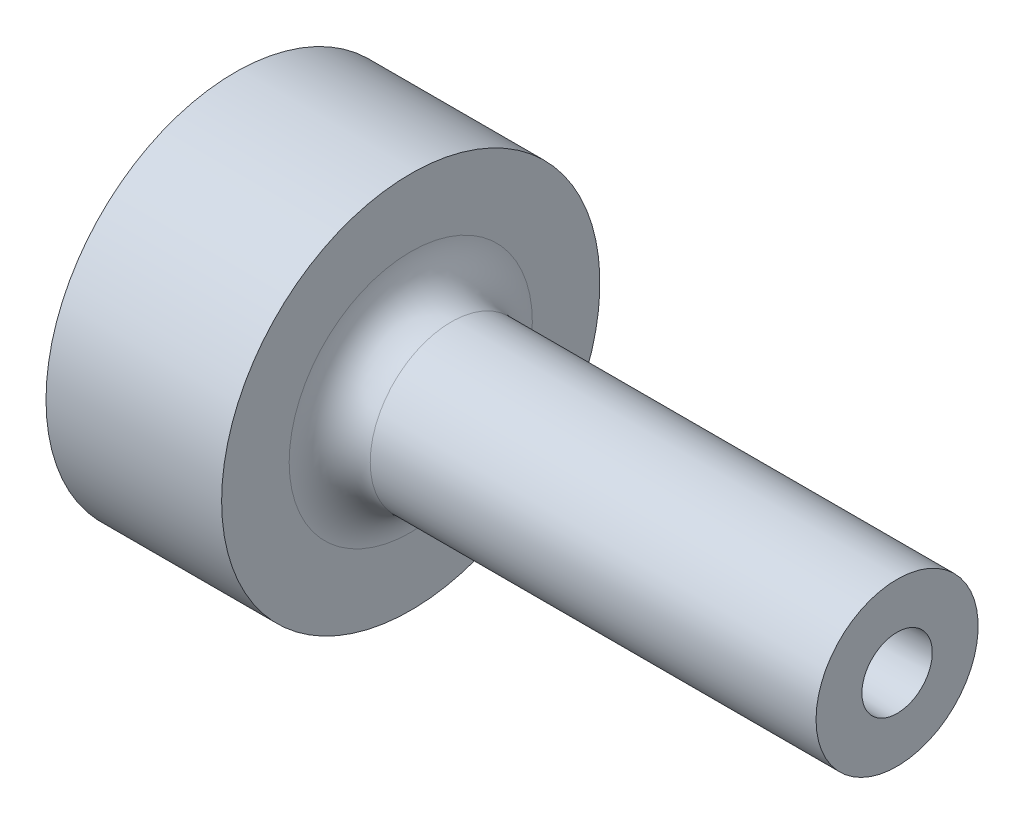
ISO-10303-21;
HEADER;
FILE_DESCRIPTION(('STEP AP214'),'2;1');
FILE_NAME('part.step','',(''),(''),'','','');
FILE_SCHEMA(('AUTOMOTIVE_DESIGN { 1 0 10303 214 1 1 1 1 }'));
ENDSEC;
DATA;
#1=APPLICATION_CONTEXT('core data for automotive mechanical design processes');
#2=APPLICATION_PROTOCOL_DEFINITION('international standard','automotive_design',2000,#1);
#3=PRODUCT_CONTEXT('',#1,'mechanical');
#4=PRODUCT('Part','Part','',(#3));
#5=PRODUCT_RELATED_PRODUCT_CATEGORY('part','',(#4));
#6=PRODUCT_DEFINITION_FORMATION('','',#4);
#7=PRODUCT_DEFINITION_CONTEXT('part definition',#1,'design');
#8=PRODUCT_DEFINITION('design','',#6,#7);
#9=PRODUCT_DEFINITION_SHAPE('','',#8);
#10=(LENGTH_UNIT() NAMED_UNIT(*) SI_UNIT(.MILLI.,.METRE.));
#11=(NAMED_UNIT(*) PLANE_ANGLE_UNIT() SI_UNIT($,.RADIAN.));
#12=(NAMED_UNIT(*) SI_UNIT($,.STERADIAN.) SOLID_ANGLE_UNIT());
#13=UNCERTAINTY_MEASURE_WITH_UNIT(LENGTH_MEASURE(1.E-05),#10,'distance_accuracy_value','');
#14=(GEOMETRIC_REPRESENTATION_CONTEXT(3) GLOBAL_UNCERTAINTY_ASSIGNED_CONTEXT((#13)) GLOBAL_UNIT_ASSIGNED_CONTEXT((#10,
#11,#12)) REPRESENTATION_CONTEXT('',''));
#15=CARTESIAN_POINT('',(0.,0.,0.));
#16=DIRECTION('',(0.,0.,1.));
#17=DIRECTION('',(1.,0.,0.));
#18=AXIS2_PLACEMENT_3D('',#15,#16,#17);
#19=CARTESIAN_POINT('',(0.,0.,0.));
#20=DIRECTION('',(-1.,0.,0.));
#21=DIRECTION('',(0.,0.,1.));
#22=AXIS2_PLACEMENT_3D('',#19,#20,#21);
#23=CYLINDRICAL_SURFACE('',#22,14.);
#24=CARTESIAN_POINT('',(13.,0.,0.));
#25=DIRECTION('',(-1.,0.,0.));
#26=DIRECTION('',(0.,0.,1.));
#27=AXIS2_PLACEMENT_3D('',#24,#25,#26);
#28=CIRCLE('',#27,14.);
#29=CARTESIAN_POINT('',(13.,0.,14.));
#30=VERTEX_POINT('',#29);
#31=EDGE_CURVE('E89',#30,#30,#28,.T.);
#32=ORIENTED_EDGE('',*,*,#31,.T.);
#33=EDGE_LOOP('',(#32));
#34=FACE_BOUND('',#33,.T.);
#35=CARTESIAN_POINT('',(0.,0.,0.));
#36=DIRECTION('',(-1.,0.,0.));
#37=DIRECTION('',(0.,0.,1.));
#38=AXIS2_PLACEMENT_3D('',#35,#36,#37);
#39=CIRCLE('',#38,14.);
#40=CARTESIAN_POINT('',(0.,0.,14.));
#41=VERTEX_POINT('',#40);
#42=EDGE_CURVE('E84',#41,#41,#39,.T.);
#43=ORIENTED_EDGE('',*,*,#42,.F.);
#44=EDGE_LOOP('',(#43));
#45=FACE_BOUND('',#44,.T.);
#46=CARTESIAN_POINT('',(6.5,-13.856406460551,-2.));
#47=CARTESIAN_POINT('',(6.61172417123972,-13.8564082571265,-1.99999534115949));
#48=CARTESIAN_POINT('',(6.72351471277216,-13.8577723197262,-1.99060664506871));
#49=CARTESIAN_POINT('',(6.9439746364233,-13.8630779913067,-1.95330740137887));
#50=CARTESIAN_POINT('',(7.05264079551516,-13.8670221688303,-1.92537839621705));
#51=CARTESIAN_POINT('',(7.26362870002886,-13.8770324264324,-1.85184738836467));
#52=CARTESIAN_POINT('',(7.36595507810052,-13.8830969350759,-1.80625847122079));
#53=CARTESIAN_POINT('',(7.56148972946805,-13.8966626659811,-1.69873175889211));
#54=CARTESIAN_POINT('',(7.65469934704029,-13.9041636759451,-1.63679637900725));
#55=CARTESIAN_POINT('',(7.83004829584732,-13.9198182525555,-1.49785346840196));
#56=CARTESIAN_POINT('',(7.91211171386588,-13.9279757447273,-1.42075056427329));
#57=CARTESIAN_POINT('',(8.06218155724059,-13.9439890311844,-1.25386707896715));
#58=CARTESIAN_POINT('',(8.13018723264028,-13.9518448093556,-1.16408582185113));
#59=CARTESIAN_POINT('',(8.25048909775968,-13.9664103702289,-0.973910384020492));
#60=CARTESIAN_POINT('',(8.30271571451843,-13.9731150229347,-0.873471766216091));
#61=CARTESIAN_POINT('',(8.38953073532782,-13.9845795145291,-0.665136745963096));
#62=CARTESIAN_POINT('',(8.4241199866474,-13.9893394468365,-0.557240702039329));
#63=CARTESIAN_POINT('',(8.47444920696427,-13.9963505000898,-0.337834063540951));
#64=CARTESIAN_POINT('',(8.49031606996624,-13.9986185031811,-0.226353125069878));
#65=CARTESIAN_POINT('',(8.5031438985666,-14.0004479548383,-0.00228956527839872));
#66=CARTESIAN_POINT('',(8.50010582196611,-14.0000095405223,0.110292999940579));
#67=CARTESIAN_POINT('',(8.47531062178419,-13.9964890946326,0.33249899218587));
#68=CARTESIAN_POINT('',(8.45369000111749,-13.9934263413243,0.442137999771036));
#69=CARTESIAN_POINT('',(8.39255744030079,-13.9850228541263,0.656215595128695));
#70=CARTESIAN_POINT('',(8.3530450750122,-13.9796820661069,0.760654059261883));
#71=CARTESIAN_POINT('',(8.25710925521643,-13.9672894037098,0.961781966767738));
#72=CARTESIAN_POINT('',(8.20062784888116,-13.9602316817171,1.05844339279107));
#73=CARTESIAN_POINT('',(8.07239950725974,-13.9451926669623,1.24096782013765));
#74=CARTESIAN_POINT('',(8.00065165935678,-13.9372113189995,1.32683017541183));
#75=CARTESIAN_POINT('',(7.843165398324,-13.921132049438,1.48612299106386));
#76=CARTESIAN_POINT('',(7.75730786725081,-13.9130337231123,1.55943569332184));
#77=CARTESIAN_POINT('',(7.57444547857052,-13.8977029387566,1.69062989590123));
#78=CARTESIAN_POINT('',(7.47744056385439,-13.890470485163,1.74851131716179));
#79=CARTESIAN_POINT('',(7.27491971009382,-13.8776905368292,1.84721301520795));
#80=CARTESIAN_POINT('',(7.1693981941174,-13.8721441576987,1.88802200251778));
#81=CARTESIAN_POINT('',(6.95290242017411,-13.8633846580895,1.9513062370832));
#82=CARTESIAN_POINT('',(6.84192850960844,-13.8601713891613,1.97378265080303));
#83=CARTESIAN_POINT('',(6.61872346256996,-13.8564698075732,1.99960390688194));
#84=CARTESIAN_POINT('',(6.50651197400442,-13.8559577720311,2.00311531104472));
#85=CARTESIAN_POINT('',(6.28310219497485,-13.8576537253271,1.9913480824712));
#86=CARTESIAN_POINT('',(6.17190387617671,-13.8598616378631,1.9760699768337));
#87=CARTESIAN_POINT('',(5.95418781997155,-13.8667269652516,1.92729837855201));
#88=CARTESIAN_POINT('',(5.84765127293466,-13.8713733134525,1.8938871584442));
#89=CARTESIAN_POINT('',(5.6416912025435,-13.8825829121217,1.80988306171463));
#90=CARTESIAN_POINT('',(5.54226800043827,-13.8891462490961,1.75928940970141));
#91=CARTESIAN_POINT('',(5.35260812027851,-13.9035064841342,1.64195360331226));
#92=CARTESIAN_POINT('',(5.26243903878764,-13.911311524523,1.57510320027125));
#93=CARTESIAN_POINT('',(5.09454027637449,-13.9272509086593,1.42730277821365));
#94=CARTESIAN_POINT('',(5.01681123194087,-13.9353852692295,1.34635203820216));
#95=CARTESIAN_POINT('',(4.8754047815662,-13.9511405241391,1.17191708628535));
#96=CARTESIAN_POINT('',(4.81183747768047,-13.9587570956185,1.07834317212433));
#97=CARTESIAN_POINT('',(4.70132443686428,-13.972552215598,0.881748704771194));
#98=CARTESIAN_POINT('',(4.65437828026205,-13.9787308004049,0.778728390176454));
#99=CARTESIAN_POINT('',(4.57861788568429,-13.9889347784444,0.566515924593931));
#100=CARTESIAN_POINT('',(4.54974241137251,-13.9929674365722,0.457345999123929));
#101=CARTESIAN_POINT('',(4.51074453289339,-13.9984555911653,0.235645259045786));
#102=CARTESIAN_POINT('',(4.50062101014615,-13.9999112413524,0.123114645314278));
#103=CARTESIAN_POINT('',(4.49943976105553,-14.0000800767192,-0.101043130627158));
#104=CARTESIAN_POINT('',(4.50821318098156,-13.998817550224,-0.212669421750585));
#105=CARTESIAN_POINT('',(4.54421615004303,-13.9937406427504,-0.432842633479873));
#106=CARTESIAN_POINT('',(4.57144565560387,-13.989926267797,-0.541389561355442));
#107=CARTESIAN_POINT('',(4.6435299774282,-13.9801722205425,-0.752283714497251));
#108=CARTESIAN_POINT('',(4.68837418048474,-13.9742338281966,-0.854634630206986));
#109=CARTESIAN_POINT('',(4.79439714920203,-13.960885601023,-1.05038570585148));
#110=CARTESIAN_POINT('',(4.8555763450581,-13.9534757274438,-1.14378562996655));
#111=CARTESIAN_POINT('',(4.99314771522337,-13.9379304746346,-1.31984194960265));
#112=CARTESIAN_POINT('',(5.06966490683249,-13.9297894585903,-1.40240016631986));
#113=CARTESIAN_POINT('',(5.2354775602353,-13.9137422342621,-1.55356716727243));
#114=CARTESIAN_POINT('',(5.32477602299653,-13.9058360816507,-1.6221726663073));
#115=CARTESIAN_POINT('',(5.51414543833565,-13.8911108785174,-1.74379523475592));
#116=CARTESIAN_POINT('',(5.61426869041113,-13.8842975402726,-1.79673154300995));
#117=CARTESIAN_POINT('',(5.82203229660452,-13.8725962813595,-1.88495902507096));
#118=CARTESIAN_POINT('',(5.92966459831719,-13.8677063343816,-1.92026877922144));
#119=CARTESIAN_POINT('',(6.11483642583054,-13.8615529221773,-1.96409255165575));
#120=CARTESIAN_POINT('',(6.19122433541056,-13.859633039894,-1.97753762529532));
#121=CARTESIAN_POINT('',(6.34506419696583,-13.857059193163,-1.99549291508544));
#122=CARTESIAN_POINT('',(6.42251613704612,-13.8564052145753,-2.00000323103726));
#123=CARTESIAN_POINT('',(6.5,-13.856406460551,-2.));
#124=B_SPLINE_CURVE_WITH_KNOTS('',3,(#46,#47,#48,#49,#50,#51,#52,#53,#54,#55,#56,#57,#58,#59,
#60,#61,#62,#63,#64,#65,#66,#67,#68,#69,#70,#71,#72,#73,#74,#75,#76,#77,#78,#79,#80,#81,#82,#83,
#84,#85,#86,#87,#88,#89,#90,#91,#92,#93,#94,#95,#96,#97,#98,#99,#100,#101,#102,#103,#104,#105,
#106,#107,#108,#109,#110,#111,#112,#113,#114,#115,#116,#117,#118,#119,#120,#121,#122,#123),
.UNSPECIFIED.,.T.,.F.,(4,2,2,2,2,2,2,2,2,2,2,2,2,2,2,2,2,2,2,2,2,2,2,2,2,2,2,2,2,2,2,2,2,2,2,2,
2,2,4),(0.,0.334889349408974,0.670112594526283,1.00508792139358,1.34001378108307,
1.6771171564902,2.01423851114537,2.35282530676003,2.6913958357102,3.02765822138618,
3.36390357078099,3.69769984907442,4.03150405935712,4.36646147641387,4.70143892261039,
5.03940517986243,5.37737316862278,5.7155642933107,6.05373389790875,6.3889286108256,
6.72411392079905,7.05779100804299,7.39148315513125,7.72746121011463,8.06345644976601,
8.40197921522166,8.74049343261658,9.07785422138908,9.41519488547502,9.74953375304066,
10.083871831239,10.4180087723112,10.7521545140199,11.0891434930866,11.426211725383,
11.7649881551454,12.103406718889,12.3356645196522,12.5679197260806),.UNSPECIFIED.);
#125=CARTESIAN_POINT('',(6.5,-13.856406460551,-2.));
#126=VERTEX_POINT('',#125);
#127=EDGE_CURVE('E10',#126,#126,#124,.T.);
#128=ORIENTED_EDGE('',*,*,#127,.F.);
#129=EDGE_LOOP('',(#128));
#130=FACE_BOUND('',#129,.T.);
#131=ADVANCED_FACE('F16',(#34,#45,#130),#23,.T.);
#132=CARTESIAN_POINT('',(0.,0.,0.));
#133=DIRECTION('',(1.,0.,0.));
#134=DIRECTION('',(0.,0.,-1.));
#135=AXIS2_PLACEMENT_3D('',#132,#133,#134);
#136=CONICAL_SURFACE('',#135,1.75,0.0174532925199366);
#137=CARTESIAN_POINT('',(49.,0.,0.));
#138=DIRECTION('',(-1.,0.,0.));
#139=DIRECTION('',(0.,0.,1.));
#140=AXIS2_PLACEMENT_3D('',#137,#138,#139);
#141=CIRCLE('',#140,2.60529818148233);
#142=CARTESIAN_POINT('',(49.,0.,2.60529818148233));
#143=VERTEX_POINT('',#142);
#144=EDGE_CURVE('E81',#143,#143,#141,.T.);
#145=ORIENTED_EDGE('',*,*,#144,.F.);
#146=EDGE_LOOP('',(#145));
#147=FACE_BOUND('',#146,.T.);
#148=CARTESIAN_POINT('',(0.8568945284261,0.,0.));
#149=DIRECTION('',(-1.,0.,0.));
#150=DIRECTION('',(0.,0.,1.));
#151=AXIS2_PLACEMENT_3D('',#148,#149,#150);
#152=CIRCLE('',#151,1.76495714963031);
#153=CARTESIAN_POINT('',(0.8568945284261,0.,1.76495714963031));
#154=VERTEX_POINT('',#153);
#155=EDGE_CURVE('E94',#154,#154,#152,.F.);
#156=ORIENTED_EDGE('',*,*,#155,.F.);
#157=EDGE_LOOP('',(#156));
#158=FACE_BOUND('',#157,.T.);
#159=ADVANCED_FACE('F45',(#147,#158),#136,.F.);
#160=CARTESIAN_POINT('',(16.,0.,0.));
#161=DIRECTION('',(-1.,0.,0.));
#162=DIRECTION('',(0.,0.,1.));
#163=AXIS2_PLACEMENT_3D('',#160,#161,#162);
#164=TOROIDAL_SURFACE('',#163,9.,3.);
#165=CARTESIAN_POINT('',(13.,0.,0.));
#166=DIRECTION('',(-1.,0.,0.));
#167=DIRECTION('',(0.,0.,1.));
#168=AXIS2_PLACEMENT_3D('',#165,#166,#167);
#169=CIRCLE('',#168,9.);
#170=CARTESIAN_POINT('',(13.,0.,9.));
#171=VERTEX_POINT('',#170);
#172=EDGE_CURVE('E91',#171,#171,#169,.T.);
#173=ORIENTED_EDGE('',*,*,#172,.F.);
#174=EDGE_LOOP('',(#173));
#175=FACE_BOUND('',#174,.T.);
#176=CARTESIAN_POINT('',(16.,0.,0.));
#177=DIRECTION('',(-1.,0.,0.));
#178=DIRECTION('',(0.,0.,1.));
#179=AXIS2_PLACEMENT_3D('',#176,#177,#178);
#180=CIRCLE('',#179,6.);
#181=CARTESIAN_POINT('',(16.,0.,6.));
#182=VERTEX_POINT('',#181);
#183=EDGE_CURVE('E28',#182,#182,#180,.T.);
#184=ORIENTED_EDGE('',*,*,#183,.T.);
#185=EDGE_LOOP('',(#184));
#186=FACE_BOUND('',#185,.T.);
#187=ADVANCED_FACE('F18',(#175,#186),#164,.F.);
#188=CARTESIAN_POINT('',(0.,0.,0.));
#189=DIRECTION('',(-1.,0.,0.));
#190=DIRECTION('',(0.,0.,1.));
#191=AXIS2_PLACEMENT_3D('',#188,#189,#190);
#192=CYLINDRICAL_SURFACE('',#191,6.);
#193=ORIENTED_EDGE('',*,*,#183,.F.);
#194=EDGE_LOOP('',(#193));
#195=FACE_BOUND('',#194,.T.);
#196=CARTESIAN_POINT('',(49.,0.,0.));
#197=DIRECTION('',(-1.,0.,0.));
#198=DIRECTION('',(0.,0.,1.));
#199=AXIS2_PLACEMENT_3D('',#196,#197,#198);
#200=CIRCLE('',#199,6.);
#201=CARTESIAN_POINT('',(49.,0.,6.));
#202=VERTEX_POINT('',#201);
#203=EDGE_CURVE('E80',#202,#202,#200,.T.);
#204=ORIENTED_EDGE('',*,*,#203,.T.);
#205=EDGE_LOOP('',(#204));
#206=FACE_BOUND('',#205,.T.);
#207=ADVANCED_FACE('F66',(#195,#206),#192,.T.);
#208=CARTESIAN_POINT('',(49.,6.,0.));
#209=DIRECTION('',(-1.,0.,0.));
#210=DIRECTION('',(0.,0.,1.));
#211=AXIS2_PLACEMENT_3D('',#208,#209,#210);
#212=PLANE('',#211);
#213=ORIENTED_EDGE('',*,*,#203,.F.);
#214=EDGE_LOOP('',(#213));
#215=FACE_BOUND('',#214,.T.);
#216=ORIENTED_EDGE('',*,*,#144,.T.);
#217=EDGE_LOOP('',(#216));
#218=FACE_BOUND('',#217,.T.);
#219=ADVANCED_FACE('F62',(#215,#218),#212,.F.);
#220=CARTESIAN_POINT('',(0.,1.75,0.));
#221=DIRECTION('',(1.,0.,0.));
#222=DIRECTION('',(0.,0.,-1.));
#223=AXIS2_PLACEMENT_3D('',#220,#221,#222);
#224=PLANE('',#223);
#225=CARTESIAN_POINT('',(0.,0.,0.));
#226=DIRECTION('',(-1.,0.,0.));
#227=DIRECTION('',(0.,0.,1.));
#228=AXIS2_PLACEMENT_3D('',#225,#226,#227);
#229=CIRCLE('',#228,5.);
#230=CARTESIAN_POINT('',(0.,0.,5.));
#231=VERTEX_POINT('',#230);
#232=EDGE_CURVE('E97',#231,#231,#229,.T.);
#233=ORIENTED_EDGE('',*,*,#232,.F.);
#234=EDGE_LOOP('',(#233));
#235=FACE_BOUND('',#234,.T.);
#236=ORIENTED_EDGE('',*,*,#42,.T.);
#237=EDGE_LOOP('',(#236));
#238=FACE_BOUND('',#237,.T.);
#239=ADVANCED_FACE('F60',(#235,#238),#224,.F.);
#240=CARTESIAN_POINT('',(13.,14.,0.));
#241=DIRECTION('',(-1.,0.,0.));
#242=DIRECTION('',(0.,0.,1.));
#243=AXIS2_PLACEMENT_3D('',#240,#241,#242);
#244=PLANE('',#243);
#245=ORIENTED_EDGE('',*,*,#31,.F.);
#246=EDGE_LOOP('',(#245));
#247=FACE_BOUND('',#246,.T.);
#248=ORIENTED_EDGE('',*,*,#172,.T.);
#249=EDGE_LOOP('',(#248));
#250=FACE_BOUND('',#249,.T.);
#251=ADVANCED_FACE('F58',(#247,#250),#244,.F.);
#252=CARTESIAN_POINT('',(-14.4672767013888,0.,0.));
#253=DIRECTION('',(-1.,0.,0.));
#254=DIRECTION('',(0.,0.,1.));
#255=AXIS2_PLACEMENT_3D('',#252,#253,#254);
#256=DEGENERATE_TOROIDAL_SURFACE('',#255,0.56308411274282,15.5,.F.);
#257=ORIENTED_EDGE('',*,*,#232,.T.);
#258=EDGE_LOOP('',(#257));
#259=FACE_BOUND('',#258,.T.);
#260=ORIENTED_EDGE('',*,*,#155,.T.);
#261=EDGE_LOOP('',(#260));
#262=FACE_BOUND('',#261,.T.);
#263=ADVANCED_FACE('F41',(#259,#262),#256,.T.);
#264=CARTESIAN_POINT('',(6.5,-14.,0.));
#265=DIRECTION('',(0.,-1.,0.));
#266=DIRECTION('',(0.,0.,-1.));
#267=AXIS2_PLACEMENT_3D('',#264,#265,#266);
#268=CYLINDRICAL_SURFACE('',#267,2.);
#269=CARTESIAN_POINT('',(6.5,-8.,0.));
#270=DIRECTION('',(0.,-1.,0.));
#271=DIRECTION('',(0.,0.,-1.));
#272=AXIS2_PLACEMENT_3D('',#269,#270,#271);
#273=CIRCLE('',#272,2.);
#274=CARTESIAN_POINT('',(6.5,-8.,-2.));
#275=VERTEX_POINT('',#274);
#276=EDGE_CURVE('E100',#275,#275,#273,.T.);
#277=ORIENTED_EDGE('',*,*,#276,.F.);
#278=EDGE_LOOP('',(#277));
#279=FACE_BOUND('',#278,.T.);
#280=ORIENTED_EDGE('',*,*,#127,.T.);
#281=EDGE_LOOP('',(#280));
#282=FACE_BOUND('',#281,.T.);
#283=ADVANCED_FACE('F33',(#279,#282),#268,.F.);
#284=CARTESIAN_POINT('',(6.5,-6.84529946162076,0.));
#285=DIRECTION('',(0.,-1.,0.));
#286=DIRECTION('',(0.,0.,-1.));
#287=AXIS2_PLACEMENT_3D('',#284,#285,#286);
#288=CONICAL_SURFACE('',#287,0.,1.0471975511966);
#289=ORIENTED_EDGE('',*,*,#276,.T.);
#290=EDGE_LOOP('',(#289));
#291=FACE_BOUND('',#290,.T.);
#292=CARTESIAN_POINT('',(6.5,-6.84529946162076,0.));
#293=VERTEX_POINT('',#292);
#294=VERTEX_LOOP('',#293);
#295=FACE_BOUND('',#294,.T.);
#296=ADVANCED_FACE('F31',(#291,#295),#288,.F.);
#297=CLOSED_SHELL('',(#131,#159,#187,#207,#219,#239,#251,#263,#283,#296));
#298=MANIFOLD_SOLID_BREP('B1',#297);
#299=ADVANCED_BREP_SHAPE_REPRESENTATION('',(#18,#298),#14);
#300=SHAPE_DEFINITION_REPRESENTATION(#9,#299);
ENDSEC;
END-ISO-10303-21;
